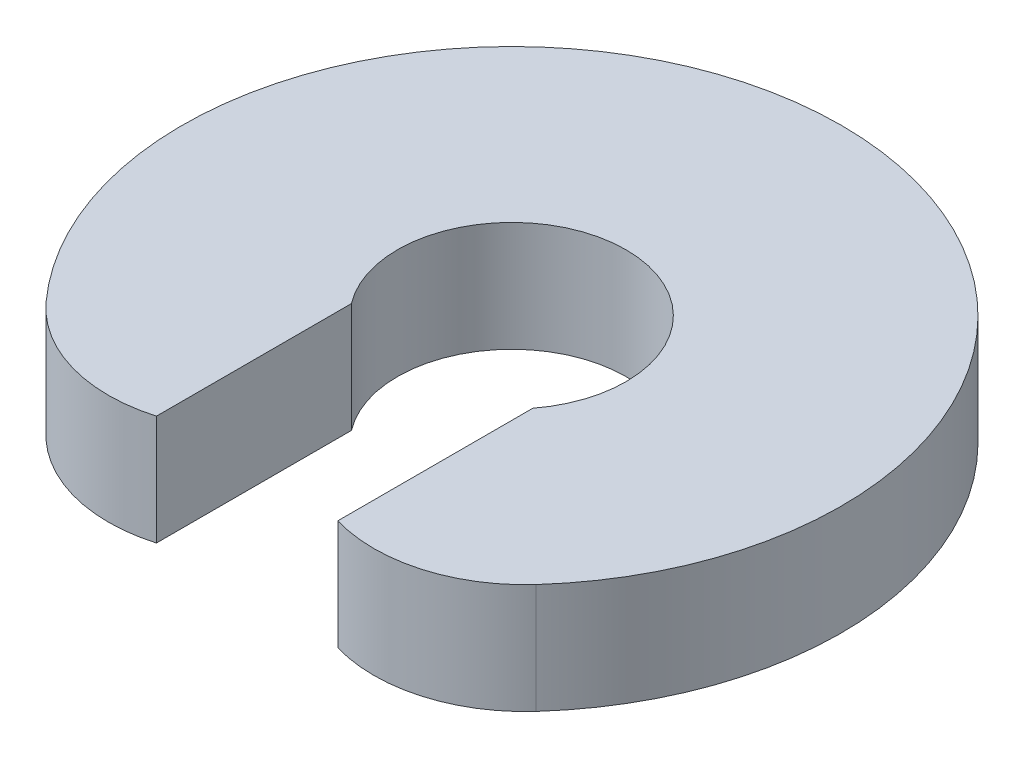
ISO-10303-21;
HEADER;
FILE_DESCRIPTION(('STEP AP214'),'2;1');
FILE_NAME('part.step','',(''),(''),'','','');
FILE_SCHEMA(('AUTOMOTIVE_DESIGN { 1 0 10303 214 1 1 1 1 }'));
ENDSEC;
DATA;
#1=APPLICATION_CONTEXT('core data for automotive mechanical design processes');
#2=APPLICATION_PROTOCOL_DEFINITION('international standard','automotive_design',2000,#1);
#3=PRODUCT_CONTEXT('',#1,'mechanical');
#4=PRODUCT('Part','Part','',(#3));
#5=PRODUCT_RELATED_PRODUCT_CATEGORY('part','',(#4));
#6=PRODUCT_DEFINITION_FORMATION('','',#4);
#7=PRODUCT_DEFINITION_CONTEXT('part definition',#1,'design');
#8=PRODUCT_DEFINITION('design','',#6,#7);
#9=PRODUCT_DEFINITION_SHAPE('','',#8);
#10=(LENGTH_UNIT() NAMED_UNIT(*) SI_UNIT(.MILLI.,.METRE.));
#11=(NAMED_UNIT(*) PLANE_ANGLE_UNIT() SI_UNIT($,.RADIAN.));
#12=(NAMED_UNIT(*) SI_UNIT($,.STERADIAN.) SOLID_ANGLE_UNIT());
#13=UNCERTAINTY_MEASURE_WITH_UNIT(LENGTH_MEASURE(1.E-05),#10,'distance_accuracy_value','');
#14=(GEOMETRIC_REPRESENTATION_CONTEXT(3) GLOBAL_UNCERTAINTY_ASSIGNED_CONTEXT((#13)) GLOBAL_UNIT_ASSIGNED_CONTEXT((#10,
#11,#12)) REPRESENTATION_CONTEXT('',''));
#15=CARTESIAN_POINT('',(0.,0.,0.));
#16=DIRECTION('',(0.,0.,1.));
#17=DIRECTION('',(1.,0.,0.));
#18=AXIS2_PLACEMENT_3D('',#15,#16,#17);
#19=CARTESIAN_POINT('',(0.,0.,0.));
#20=DIRECTION('',(0.,1.,0.));
#21=DIRECTION('',(0.,0.,1.));
#22=AXIS2_PLACEMENT_3D('',#19,#20,#21);
#23=PLANE('',#22);
#24=CARTESIAN_POINT('',(241.522068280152,0.,217.46744706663));
#25=DIRECTION('',(0.,-1.,0.));
#26=DIRECTION('',(0.,0.,-1.));
#27=AXIS2_PLACEMENT_3D('',#24,#25,#26);
#28=CIRCLE('',#27,275.);
#29=CARTESIAN_POINT('',(165.,0.,481.606374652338));
#30=VERTEX_POINT('',#29);
#31=CARTESIAN_POINT('',(445.886895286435,0.,401.478363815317));
#32=VERTEX_POINT('',#31);
#33=EDGE_CURVE('E94',#30,#32,#28,.F.);
#34=ORIENTED_EDGE('',*,*,#33,.F.);
#35=DIRECTION('',(0.,0.,-1.));
#36=VECTOR('',#35,1.);
#37=CARTESIAN_POINT('',(165.,0.,0.));
#38=LINE('',#37,#36);
#39=CARTESIAN_POINT('',(165.,0.,126.645173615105));
#40=VERTEX_POINT('',#39);
#41=EDGE_CURVE('E92',#30,#40,#38,.T.);
#42=ORIENTED_EDGE('',*,*,#41,.T.);
#43=CARTESIAN_POINT('',(0.,0.,0.));
#44=DIRECTION('',(0.,-1.,0.));
#45=DIRECTION('',(0.,0.,-1.));
#46=AXIS2_PLACEMENT_3D('',#43,#44,#45);
#47=CIRCLE('',#46,208.);
#48=CARTESIAN_POINT('',(-165.,0.,126.645173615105));
#49=VERTEX_POINT('',#48);
#50=EDGE_CURVE('E104',#40,#49,#47,.F.);
#51=ORIENTED_EDGE('',*,*,#50,.T.);
#52=DIRECTION('',(0.,0.,-1.));
#53=VECTOR('',#52,1.);
#54=CARTESIAN_POINT('',(-165.,0.,0.));
#55=LINE('',#54,#53);
#56=CARTESIAN_POINT('',(-165.,0.,481.606374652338));
#57=VERTEX_POINT('',#56);
#58=EDGE_CURVE('E71',#57,#49,#55,.T.);
#59=ORIENTED_EDGE('',*,*,#58,.F.);
#60=CARTESIAN_POINT('',(-241.522068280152,0.,217.46744706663));
#61=DIRECTION('',(0.,-1.,0.));
#62=DIRECTION('',(0.,0.,-1.));
#63=AXIS2_PLACEMENT_3D('',#60,#61,#62);
#64=CIRCLE('',#63,275.);
#65=CARTESIAN_POINT('',(-445.886895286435,0.,401.478363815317));
#66=VERTEX_POINT('',#65);
#67=EDGE_CURVE('E67',#66,#57,#64,.F.);
#68=ORIENTED_EDGE('',*,*,#67,.F.);
#69=CARTESIAN_POINT('',(0.,0.,0.));
#70=DIRECTION('',(0.,-1.,0.));
#71=DIRECTION('',(0.,0.,-1.));
#72=AXIS2_PLACEMENT_3D('',#69,#70,#71);
#73=CIRCLE('',#72,600.);
#74=EDGE_CURVE('E19',#32,#66,#73,.F.);
#75=ORIENTED_EDGE('',*,*,#74,.F.);
#76=EDGE_LOOP('',(#34,#42,#51,#59,#68,#75));
#77=FACE_BOUND('',#76,.T.);
#78=ADVANCED_FACE('F16',(#77),#23,.F.);
#79=CARTESIAN_POINT('',(0.,200.,0.));
#80=DIRECTION('',(0.,-1.,0.));
#81=DIRECTION('',(0.,0.,-1.));
#82=AXIS2_PLACEMENT_3D('',#79,#80,#81);
#83=CYLINDRICAL_SURFACE('',#82,600.);
#84=ORIENTED_EDGE('',*,*,#74,.T.);
#85=DIRECTION('',(0.,-1.,0.));
#86=VECTOR('',#85,1.);
#87=CARTESIAN_POINT('',(-445.886895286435,200.,401.478363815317));
#88=LINE('',#87,#86);
#89=CARTESIAN_POINT('',(-445.886895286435,200.,401.478363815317));
#90=VERTEX_POINT('',#89);
#91=EDGE_CURVE('E75',#90,#66,#88,.T.);
#92=ORIENTED_EDGE('',*,*,#91,.F.);
#93=CARTESIAN_POINT('',(0.,200.,0.));
#94=DIRECTION('',(0.,-1.,0.));
#95=DIRECTION('',(0.,0.,-1.));
#96=AXIS2_PLACEMENT_3D('',#93,#94,#95);
#97=CIRCLE('',#96,600.);
#98=CARTESIAN_POINT('',(445.886895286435,200.,401.478363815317));
#99=VERTEX_POINT('',#98);
#100=EDGE_CURVE('E101',#99,#90,#97,.F.);
#101=ORIENTED_EDGE('',*,*,#100,.F.);
#102=DIRECTION('',(0.,-1.,0.));
#103=VECTOR('',#102,1.);
#104=CARTESIAN_POINT('',(445.886895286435,200.,401.478363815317));
#105=LINE('',#104,#103);
#106=EDGE_CURVE('E81',#32,#99,#105,.F.);
#107=ORIENTED_EDGE('',*,*,#106,.F.);
#108=EDGE_LOOP('',(#84,#92,#101,#107));
#109=FACE_BOUND('',#108,.T.);
#110=ADVANCED_FACE('F78',(#109),#83,.T.);
#111=CARTESIAN_POINT('',(-241.522068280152,200.,217.46744706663));
#112=DIRECTION('',(0.,-1.,0.));
#113=DIRECTION('',(0.,0.,-1.));
#114=AXIS2_PLACEMENT_3D('',#111,#112,#113);
#115=CYLINDRICAL_SURFACE('',#114,275.);
#116=CARTESIAN_POINT('',(-241.522068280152,200.,217.46744706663));
#117=DIRECTION('',(0.,-1.,0.));
#118=DIRECTION('',(0.,0.,-1.));
#119=AXIS2_PLACEMENT_3D('',#116,#117,#118);
#120=CIRCLE('',#119,275.);
#121=CARTESIAN_POINT('',(-165.,200.,481.606374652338));
#122=VERTEX_POINT('',#121);
#123=EDGE_CURVE('E85',#90,#122,#120,.F.);
#124=ORIENTED_EDGE('',*,*,#123,.F.);
#125=ORIENTED_EDGE('',*,*,#91,.T.);
#126=ORIENTED_EDGE('',*,*,#67,.T.);
#127=DIRECTION('',(0.,1.,0.));
#128=VECTOR('',#127,1.);
#129=CARTESIAN_POINT('',(-165.,200.,481.606374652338));
#130=LINE('',#129,#128);
#131=EDGE_CURVE('E87',#122,#57,#130,.F.);
#132=ORIENTED_EDGE('',*,*,#131,.F.);
#133=EDGE_LOOP('',(#124,#125,#126,#132));
#134=FACE_BOUND('',#133,.T.);
#135=ADVANCED_FACE('F83',(#134),#115,.T.);
#136=CARTESIAN_POINT('',(-165.,200.,0.));
#137=DIRECTION('',(1.,0.,0.));
#138=DIRECTION('',(0.,0.,-1.));
#139=AXIS2_PLACEMENT_3D('',#136,#137,#138);
#140=PLANE('',#139);
#141=DIRECTION('',(0.,0.,1.));
#142=VECTOR('',#141,1.);
#143=CARTESIAN_POINT('',(-165.,200.,0.));
#144=LINE('',#143,#142);
#145=CARTESIAN_POINT('',(-165.,200.,126.645173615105));
#146=VERTEX_POINT('',#145);
#147=EDGE_CURVE('E99',#122,#146,#144,.F.);
#148=ORIENTED_EDGE('',*,*,#147,.F.);
#149=ORIENTED_EDGE('',*,*,#131,.T.);
#150=ORIENTED_EDGE('',*,*,#58,.T.);
#151=DIRECTION('',(0.,-1.,0.));
#152=VECTOR('',#151,1.);
#153=CARTESIAN_POINT('',(-165.,200.,126.645173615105));
#154=LINE('',#153,#152);
#155=EDGE_CURVE('E105',#49,#146,#154,.F.);
#156=ORIENTED_EDGE('',*,*,#155,.T.);
#157=EDGE_LOOP('',(#148,#149,#150,#156));
#158=FACE_BOUND('',#157,.T.);
#159=ADVANCED_FACE('F138',(#158),#140,.T.);
#160=CARTESIAN_POINT('',(0.,200.,0.));
#161=DIRECTION('',(0.,-1.,0.));
#162=DIRECTION('',(0.,0.,-1.));
#163=AXIS2_PLACEMENT_3D('',#160,#161,#162);
#164=CYLINDRICAL_SURFACE('',#163,208.);
#165=DIRECTION('',(0.,1.,0.));
#166=VECTOR('',#165,1.);
#167=CARTESIAN_POINT('',(165.,200.,126.645173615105));
#168=LINE('',#167,#166);
#169=CARTESIAN_POINT('',(165.,200.,126.645173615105));
#170=VERTEX_POINT('',#169);
#171=EDGE_CURVE('E95',#40,#170,#168,.T.);
#172=ORIENTED_EDGE('',*,*,#171,.T.);
#173=CARTESIAN_POINT('',(0.,200.,0.));
#174=DIRECTION('',(0.,-1.,0.));
#175=DIRECTION('',(0.,0.,-1.));
#176=AXIS2_PLACEMENT_3D('',#173,#174,#175);
#177=CIRCLE('',#176,208.);
#178=EDGE_CURVE('E97',#146,#170,#177,.T.);
#179=ORIENTED_EDGE('',*,*,#178,.F.);
#180=ORIENTED_EDGE('',*,*,#155,.F.);
#181=ORIENTED_EDGE('',*,*,#50,.F.);
#182=EDGE_LOOP('',(#172,#179,#180,#181));
#183=FACE_BOUND('',#182,.T.);
#184=ADVANCED_FACE('F123',(#183),#164,.F.);
#185=CARTESIAN_POINT('',(165.,200.,0.));
#186=DIRECTION('',(1.,0.,0.));
#187=DIRECTION('',(0.,0.,-1.));
#188=AXIS2_PLACEMENT_3D('',#185,#186,#187);
#189=PLANE('',#188);
#190=DIRECTION('',(0.,-1.,0.));
#191=VECTOR('',#190,1.);
#192=CARTESIAN_POINT('',(165.,200.,481.606374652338));
#193=LINE('',#192,#191);
#194=CARTESIAN_POINT('',(165.,200.,481.606374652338));
#195=VERTEX_POINT('',#194);
#196=EDGE_CURVE('E34',#195,#30,#193,.T.);
#197=ORIENTED_EDGE('',*,*,#196,.F.);
#198=DIRECTION('',(0.,0.,1.));
#199=VECTOR('',#198,1.);
#200=CARTESIAN_POINT('',(165.,200.,0.));
#201=LINE('',#200,#199);
#202=EDGE_CURVE('E25',#170,#195,#201,.T.);
#203=ORIENTED_EDGE('',*,*,#202,.F.);
#204=ORIENTED_EDGE('',*,*,#171,.F.);
#205=ORIENTED_EDGE('',*,*,#41,.F.);
#206=EDGE_LOOP('',(#197,#203,#204,#205));
#207=FACE_BOUND('',#206,.T.);
#208=ADVANCED_FACE('F121',(#207),#189,.F.);
#209=CARTESIAN_POINT('',(241.522068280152,200.,217.46744706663));
#210=DIRECTION('',(0.,-1.,0.));
#211=DIRECTION('',(0.,0.,-1.));
#212=AXIS2_PLACEMENT_3D('',#209,#210,#211);
#213=CYLINDRICAL_SURFACE('',#212,275.);
#214=CARTESIAN_POINT('',(241.522068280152,200.,217.46744706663));
#215=DIRECTION('',(0.,-1.,0.));
#216=DIRECTION('',(0.,0.,-1.));
#217=AXIS2_PLACEMENT_3D('',#214,#215,#216);
#218=CIRCLE('',#217,275.);
#219=EDGE_CURVE('E11',#195,#99,#218,.F.);
#220=ORIENTED_EDGE('',*,*,#219,.F.);
#221=ORIENTED_EDGE('',*,*,#196,.T.);
#222=ORIENTED_EDGE('',*,*,#33,.T.);
#223=ORIENTED_EDGE('',*,*,#106,.T.);
#224=EDGE_LOOP('',(#220,#221,#222,#223));
#225=FACE_BOUND('',#224,.T.);
#226=ADVANCED_FACE('F125',(#225),#213,.T.);
#227=CARTESIAN_POINT('',(0.,200.,0.));
#228=DIRECTION('',(0.,1.,0.));
#229=DIRECTION('',(0.,0.,1.));
#230=AXIS2_PLACEMENT_3D('',#227,#228,#229);
#231=PLANE('',#230);
#232=ORIENTED_EDGE('',*,*,#202,.T.);
#233=ORIENTED_EDGE('',*,*,#219,.T.);
#234=ORIENTED_EDGE('',*,*,#100,.T.);
#235=ORIENTED_EDGE('',*,*,#123,.T.);
#236=ORIENTED_EDGE('',*,*,#147,.T.);
#237=ORIENTED_EDGE('',*,*,#178,.T.);
#238=EDGE_LOOP('',(#232,#233,#234,#235,#236,#237));
#239=FACE_BOUND('',#238,.T.);
#240=ADVANCED_FACE('F119',(#239),#231,.T.);
#241=CLOSED_SHELL('',(#78,#110,#135,#159,#184,#208,#226,#240));
#242=MANIFOLD_SOLID_BREP('B1',#241);
#243=ADVANCED_BREP_SHAPE_REPRESENTATION('',(#18,#242),#14);
#244=SHAPE_DEFINITION_REPRESENTATION(#9,#243);
ENDSEC;
END-ISO-10303-21;
